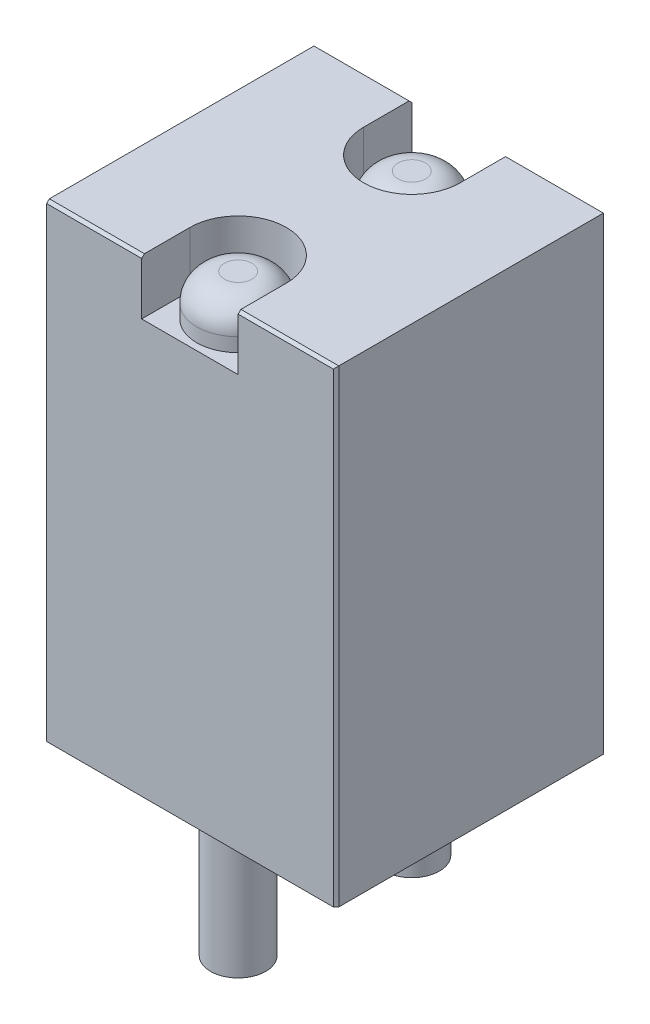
ISO-10303-21;
HEADER;
FILE_DESCRIPTION(('STEP AP214'),'2;1');
FILE_NAME('part.step','',(''),(''),'','','');
FILE_SCHEMA(('AUTOMOTIVE_DESIGN { 1 0 10303 214 1 1 1 1 }'));
ENDSEC;
DATA;
#1=APPLICATION_CONTEXT('core data for automotive mechanical design processes');
#2=APPLICATION_PROTOCOL_DEFINITION('international standard','automotive_design',2000,#1);
#3=PRODUCT_CONTEXT('',#1,'mechanical');
#4=PRODUCT('Part','Part','',(#3));
#5=PRODUCT_RELATED_PRODUCT_CATEGORY('part','',(#4));
#6=PRODUCT_DEFINITION_FORMATION('','',#4);
#7=PRODUCT_DEFINITION_CONTEXT('part definition',#1,'design');
#8=PRODUCT_DEFINITION('design','',#6,#7);
#9=PRODUCT_DEFINITION_SHAPE('','',#8);
#10=(LENGTH_UNIT() NAMED_UNIT(*) SI_UNIT(.MILLI.,.METRE.));
#11=(NAMED_UNIT(*) PLANE_ANGLE_UNIT() SI_UNIT($,.RADIAN.));
#12=(NAMED_UNIT(*) SI_UNIT($,.STERADIAN.) SOLID_ANGLE_UNIT());
#13=UNCERTAINTY_MEASURE_WITH_UNIT(LENGTH_MEASURE(1.E-05),#10,'distance_accuracy_value','');
#14=(GEOMETRIC_REPRESENTATION_CONTEXT(3) GLOBAL_UNCERTAINTY_ASSIGNED_CONTEXT((#13)) GLOBAL_UNIT_ASSIGNED_CONTEXT((#10,
#11,#12)) REPRESENTATION_CONTEXT('',''));
#15=CARTESIAN_POINT('',(0.,0.,0.));
#16=DIRECTION('',(0.,0.,1.));
#17=DIRECTION('',(1.,0.,0.));
#18=AXIS2_PLACEMENT_3D('',#15,#16,#17);
#19=CARTESIAN_POINT('',(-5.3,15.,-3.15));
#20=DIRECTION('',(0.,-1.,0.));
#21=DIRECTION('',(0.,0.,-1.));
#22=AXIS2_PLACEMENT_3D('',#19,#20,#21);
#23=PLANE('',#22);
#24=CARTESIAN_POINT('',(-5.3,15.,-3.15));
#25=DIRECTION('',(0.,1.,0.));
#26=DIRECTION('',(0.,0.,-1.));
#27=AXIS2_PLACEMENT_3D('',#24,#25,#26);
#28=CIRCLE('',#27,1.75);
#29=CARTESIAN_POINT('',(-7.05,15.,-3.15));
#30=VERTEX_POINT('',#29);
#31=CARTESIAN_POINT('',(-3.55,15.,-3.15));
#32=VERTEX_POINT('',#31);
#33=EDGE_CURVE('E179',#30,#32,#28,.T.);
#34=ORIENTED_EDGE('',*,*,#33,.T.);
#35=DIRECTION('',(0.,0.,-1.));
#36=VECTOR('',#35,1.);
#37=CARTESIAN_POINT('',(-3.55,15.,-3.15));
#38=LINE('',#37,#36);
#39=CARTESIAN_POINT('',(-3.55,15.,-4.9));
#40=VERTEX_POINT('',#39);
#41=EDGE_CURVE('E156',#32,#40,#38,.T.);
#42=ORIENTED_EDGE('',*,*,#41,.T.);
#43=DIRECTION('',(-1.,0.,0.));
#44=VECTOR('',#43,1.);
#45=CARTESIAN_POINT('',(-3.55,15.,-4.9));
#46=LINE('',#45,#44);
#47=CARTESIAN_POINT('',(-7.05,15.,-4.9));
#48=VERTEX_POINT('',#47);
#49=EDGE_CURVE('E185',#40,#48,#46,.T.);
#50=ORIENTED_EDGE('',*,*,#49,.T.);
#51=DIRECTION('',(0.,0.,1.));
#52=VECTOR('',#51,1.);
#53=CARTESIAN_POINT('',(-7.05,15.,-3.15));
#54=LINE('',#53,#52);
#55=EDGE_CURVE('E161',#48,#30,#54,.T.);
#56=ORIENTED_EDGE('',*,*,#55,.T.);
#57=EDGE_LOOP('',(#34,#42,#50,#56));
#58=FACE_BOUND('',#57,.T.);
#59=CARTESIAN_POINT('',(-5.3,15.,-3.15));
#60=DIRECTION('',(0.,-1.,0.));
#61=DIRECTION('',(0.,0.,-1.));
#62=AXIS2_PLACEMENT_3D('',#59,#60,#61);
#63=CIRCLE('',#62,1.5);
#64=CARTESIAN_POINT('',(-5.3,15.,-4.65));
#65=VERTEX_POINT('',#64);
#66=EDGE_CURVE('E236',#65,#65,#63,.F.);
#67=ORIENTED_EDGE('',*,*,#66,.F.);
#68=EDGE_LOOP('',(#67));
#69=FACE_BOUND('',#68,.T.);
#70=ADVANCED_FACE('F29',(#58,#69),#23,.F.);
#71=CARTESIAN_POINT('',(-5.3,15.,3.15));
#72=DIRECTION('',(0.,1.,0.));
#73=DIRECTION('',(0.,0.,1.));
#74=AXIS2_PLACEMENT_3D('',#71,#72,#73);
#75=PLANE('',#74);
#76=CARTESIAN_POINT('',(-5.3,15.,3.15));
#77=DIRECTION('',(0.,1.,0.));
#78=DIRECTION('',(0.,0.,1.));
#79=AXIS2_PLACEMENT_3D('',#76,#77,#78);
#80=CIRCLE('',#79,1.75);
#81=CARTESIAN_POINT('',(-3.55,15.,3.15));
#82=VERTEX_POINT('',#81);
#83=CARTESIAN_POINT('',(-7.05,15.,3.15));
#84=VERTEX_POINT('',#83);
#85=EDGE_CURVE('E202',#82,#84,#80,.T.);
#86=ORIENTED_EDGE('',*,*,#85,.T.);
#87=DIRECTION('',(0.,0.,1.));
#88=VECTOR('',#87,1.);
#89=CARTESIAN_POINT('',(-7.05,15.,3.15));
#90=LINE('',#89,#88);
#91=CARTESIAN_POINT('',(-7.05,15.,4.9));
#92=VERTEX_POINT('',#91);
#93=EDGE_CURVE('E205',#84,#92,#90,.T.);
#94=ORIENTED_EDGE('',*,*,#93,.T.);
#95=DIRECTION('',(1.,0.,0.));
#96=VECTOR('',#95,1.);
#97=CARTESIAN_POINT('',(-3.55,15.,4.9));
#98=LINE('',#97,#96);
#99=CARTESIAN_POINT('',(-3.55,15.,4.9));
#100=VERTEX_POINT('',#99);
#101=EDGE_CURVE('E207',#92,#100,#98,.T.);
#102=ORIENTED_EDGE('',*,*,#101,.T.);
#103=DIRECTION('',(0.,0.,-1.));
#104=VECTOR('',#103,1.);
#105=CARTESIAN_POINT('',(-3.55,15.,3.15));
#106=LINE('',#105,#104);
#107=EDGE_CURVE('E209',#100,#82,#106,.T.);
#108=ORIENTED_EDGE('',*,*,#107,.T.);
#109=EDGE_LOOP('',(#86,#94,#102,#108));
#110=FACE_BOUND('',#109,.T.);
#111=CARTESIAN_POINT('',(-5.3,15.,3.15));
#112=DIRECTION('',(0.,1.,0.));
#113=DIRECTION('',(0.,0.,1.));
#114=AXIS2_PLACEMENT_3D('',#111,#112,#113);
#115=CIRCLE('',#114,1.5);
#116=CARTESIAN_POINT('',(-5.3,15.,4.65));
#117=VERTEX_POINT('',#116);
#118=EDGE_CURVE('E339',#117,#117,#115,.T.);
#119=ORIENTED_EDGE('',*,*,#118,.F.);
#120=EDGE_LOOP('',(#119));
#121=FACE_BOUND('',#120,.T.);
#122=ADVANCED_FACE('F377',(#110,#121),#75,.T.);
#123=CARTESIAN_POINT('',(0.,0.,-4.9));
#124=DIRECTION('',(1.,0.,0.));
#125=DIRECTION('',(0.,0.,-1.));
#126=AXIS2_PLACEMENT_3D('',#123,#124,#125);
#127=PLANE('',#126);
#128=DIRECTION('',(0.,0.,1.));
#129=VECTOR('',#128,1.);
#130=CARTESIAN_POINT('',(0.,0.,-4.9));
#131=LINE('',#130,#129);
#132=CARTESIAN_POINT('',(0.,0.,-4.8));
#133=VERTEX_POINT('',#132);
#134=CARTESIAN_POINT('',(0.,0.,4.8));
#135=VERTEX_POINT('',#134);
#136=EDGE_CURVE('E233',#133,#135,#131,.T.);
#137=ORIENTED_EDGE('',*,*,#136,.F.);
#138=DIRECTION('',(0.,1.,0.));
#139=VECTOR('',#138,1.);
#140=CARTESIAN_POINT('',(0.,0.,-4.8));
#141=LINE('',#140,#139);
#142=CARTESIAN_POINT('',(0.,17.,-4.8));
#143=VERTEX_POINT('',#142);
#144=EDGE_CURVE('E283',#133,#143,#141,.T.);
#145=ORIENTED_EDGE('',*,*,#144,.T.);
#146=DIRECTION('',(0.,0.,1.));
#147=VECTOR('',#146,1.);
#148=CARTESIAN_POINT('',(0.,17.,-4.9));
#149=LINE('',#148,#147);
#150=CARTESIAN_POINT('',(0.,17.,4.8));
#151=VERTEX_POINT('',#150);
#152=EDGE_CURVE('E232',#143,#151,#149,.T.);
#153=ORIENTED_EDGE('',*,*,#152,.T.);
#154=DIRECTION('',(0.,-1.,0.));
#155=VECTOR('',#154,1.);
#156=CARTESIAN_POINT('',(0.,0.,4.8));
#157=LINE('',#156,#155);
#158=EDGE_CURVE('E281',#151,#135,#157,.T.);
#159=ORIENTED_EDGE('',*,*,#158,.T.);
#160=EDGE_LOOP('',(#137,#145,#153,#159));
#161=FACE_BOUND('',#160,.T.);
#162=ADVANCED_FACE('F31',(#161),#127,.T.);
#163=CARTESIAN_POINT('',(-10.5,0.,-4.9));
#164=DIRECTION('',(0.,-1.,0.));
#165=DIRECTION('',(0.,0.,-1.));
#166=AXIS2_PLACEMENT_3D('',#163,#164,#165);
#167=PLANE('',#166);
#168=CARTESIAN_POINT('',(-5.3,0.,3.15));
#169=DIRECTION('',(0.,1.,0.));
#170=DIRECTION('',(0.,0.,1.));
#171=AXIS2_PLACEMENT_3D('',#168,#169,#170);
#172=CIRCLE('',#171,1.25);
#173=CARTESIAN_POINT('',(-5.3,0.,4.4));
#174=VERTEX_POINT('',#173);
#175=EDGE_CURVE('E345',#174,#174,#172,.T.);
#176=ORIENTED_EDGE('',*,*,#175,.T.);
#177=EDGE_LOOP('',(#176));
#178=FACE_BOUND('',#177,.T.);
#179=CARTESIAN_POINT('',(-5.3,0.,-3.15));
#180=DIRECTION('',(0.,1.,0.));
#181=DIRECTION('',(0.,0.,1.));
#182=AXIS2_PLACEMENT_3D('',#179,#180,#181);
#183=CIRCLE('',#182,1.25);
#184=CARTESIAN_POINT('',(-5.3,0.,-1.9));
#185=VERTEX_POINT('',#184);
#186=EDGE_CURVE('E170',#185,#185,#183,.T.);
#187=ORIENTED_EDGE('',*,*,#186,.T.);
#188=EDGE_LOOP('',(#187));
#189=FACE_BOUND('',#188,.T.);
#190=DIRECTION('',(1.,0.,0.));
#191=VECTOR('',#190,1.);
#192=CARTESIAN_POINT('',(-10.5,0.,-4.9));
#193=LINE('',#192,#191);
#194=CARTESIAN_POINT('',(-10.5,0.,-4.9));
#195=VERTEX_POINT('',#194);
#196=CARTESIAN_POINT('',(-0.100000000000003,0.,-4.9));
#197=VERTEX_POINT('',#196);
#198=EDGE_CURVE('E229',#195,#197,#193,.T.);
#199=ORIENTED_EDGE('',*,*,#198,.T.);
#200=DIRECTION('',(-0.707106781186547,0.,-0.707106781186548));
#201=VECTOR('',#200,1.);
#202=CARTESIAN_POINT('',(-5.29999999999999,0.,-10.1));
#203=LINE('',#202,#201);
#204=EDGE_CURVE('E287',#197,#133,#203,.F.);
#205=ORIENTED_EDGE('',*,*,#204,.T.);
#206=ORIENTED_EDGE('',*,*,#136,.T.);
#207=DIRECTION('',(-0.707106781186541,0.,0.707106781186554));
#208=VECTOR('',#207,1.);
#209=CARTESIAN_POINT('',(-0.399999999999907,0.,5.19999999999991));
#210=LINE('',#209,#208);
#211=CARTESIAN_POINT('',(-0.0999999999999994,0.,4.9));
#212=VERTEX_POINT('',#211);
#213=EDGE_CURVE('E285',#135,#212,#210,.T.);
#214=ORIENTED_EDGE('',*,*,#213,.T.);
#215=DIRECTION('',(1.,0.,0.));
#216=VECTOR('',#215,1.);
#217=CARTESIAN_POINT('',(-10.5,0.,4.9));
#218=LINE('',#217,#216);
#219=CARTESIAN_POINT('',(-10.5,0.,4.9));
#220=VERTEX_POINT('',#219);
#221=EDGE_CURVE('E224',#220,#212,#218,.T.);
#222=ORIENTED_EDGE('',*,*,#221,.F.);
#223=DIRECTION('',(0.,0.,1.));
#224=VECTOR('',#223,1.);
#225=CARTESIAN_POINT('',(-10.5,0.,-4.9));
#226=LINE('',#225,#224);
#227=EDGE_CURVE('E237',#195,#220,#226,.T.);
#228=ORIENTED_EDGE('',*,*,#227,.F.);
#229=EDGE_LOOP('',(#199,#205,#206,#214,#222,#228));
#230=FACE_BOUND('',#229,.T.);
#231=ADVANCED_FACE('F310',(#178,#189,#230),#167,.T.);
#232=CARTESIAN_POINT('',(-10.5,17.,-4.9));
#233=DIRECTION('',(-1.,0.,0.));
#234=DIRECTION('',(0.,-1.,0.));
#235=AXIS2_PLACEMENT_3D('',#232,#233,#234);
#236=PLANE('',#235);
#237=DIRECTION('',(0.,0.,1.));
#238=VECTOR('',#237,1.);
#239=CARTESIAN_POINT('',(-10.5,17.,-4.9));
#240=LINE('',#239,#238);
#241=CARTESIAN_POINT('',(-10.5,17.,-4.8));
#242=VERTEX_POINT('',#241);
#243=CARTESIAN_POINT('',(-10.5,17.,4.8));
#244=VERTEX_POINT('',#243);
#245=EDGE_CURVE('E240',#242,#244,#240,.T.);
#246=ORIENTED_EDGE('',*,*,#245,.F.);
#247=DIRECTION('',(0.,0.707106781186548,0.707106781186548));
#248=VECTOR('',#247,1.);
#249=CARTESIAN_POINT('',(-10.5,16.95,-4.85));
#250=LINE('',#249,#248);
#251=CARTESIAN_POINT('',(-10.5,16.9,-4.9));
#252=VERTEX_POINT('',#251);
#253=EDGE_CURVE('E269',#242,#252,#250,.F.);
#254=ORIENTED_EDGE('',*,*,#253,.T.);
#255=DIRECTION('',(0.,-1.,0.));
#256=VECTOR('',#255,1.);
#257=CARTESIAN_POINT('',(-10.5,17.,-4.9));
#258=LINE('',#257,#256);
#259=EDGE_CURVE('E227',#252,#195,#258,.T.);
#260=ORIENTED_EDGE('',*,*,#259,.T.);
#261=ORIENTED_EDGE('',*,*,#227,.T.);
#262=DIRECTION('',(0.,-1.,0.));
#263=VECTOR('',#262,1.);
#264=CARTESIAN_POINT('',(-10.5,17.,4.9));
#265=LINE('',#264,#263);
#266=CARTESIAN_POINT('',(-10.5,16.9,4.9));
#267=VERTEX_POINT('',#266);
#268=EDGE_CURVE('E216',#267,#220,#265,.T.);
#269=ORIENTED_EDGE('',*,*,#268,.F.);
#270=DIRECTION('',(0.,0.707106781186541,-0.707106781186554));
#271=VECTOR('',#270,1.);
#272=CARTESIAN_POINT('',(-10.5,21.85,-0.0500000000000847));
#273=LINE('',#272,#271);
#274=EDGE_CURVE('E267',#267,#244,#273,.T.);
#275=ORIENTED_EDGE('',*,*,#274,.T.);
#276=EDGE_LOOP('',(#246,#254,#260,#261,#269,#275));
#277=FACE_BOUND('',#276,.T.);
#278=ADVANCED_FACE('F304',(#277),#236,.T.);
#279=CARTESIAN_POINT('',(-10.5,17.,-4.9));
#280=DIRECTION('',(0.,1.,0.));
#281=DIRECTION('',(0.,0.,1.));
#282=AXIS2_PLACEMENT_3D('',#279,#280,#281);
#283=PLANE('',#282);
#284=DIRECTION('',(0.,0.,1.));
#285=VECTOR('',#284,1.);
#286=CARTESIAN_POINT('',(-7.05,17.,-3.15));
#287=LINE('',#286,#285);
#288=CARTESIAN_POINT('',(-7.05,17.,-4.8));
#289=VERTEX_POINT('',#288);
#290=CARTESIAN_POINT('',(-7.05,17.,-3.15));
#291=VERTEX_POINT('',#290);
#292=EDGE_CURVE('E177',#289,#291,#287,.T.);
#293=ORIENTED_EDGE('',*,*,#292,.F.);
#294=DIRECTION('',(-1.,0.,0.));
#295=VECTOR('',#294,1.);
#296=CARTESIAN_POINT('',(-10.5,17.,-4.8));
#297=LINE('',#296,#295);
#298=EDGE_CURVE('E264',#289,#242,#297,.T.);
#299=ORIENTED_EDGE('',*,*,#298,.T.);
#300=ORIENTED_EDGE('',*,*,#245,.T.);
#301=DIRECTION('',(1.,0.,0.));
#302=VECTOR('',#301,1.);
#303=CARTESIAN_POINT('',(-7.05,17.,4.8));
#304=LINE('',#303,#302);
#305=CARTESIAN_POINT('',(-7.05,17.,4.8));
#306=VERTEX_POINT('',#305);
#307=EDGE_CURVE('E261',#244,#306,#304,.T.);
#308=ORIENTED_EDGE('',*,*,#307,.T.);
#309=DIRECTION('',(0.,0.,1.));
#310=VECTOR('',#309,1.);
#311=CARTESIAN_POINT('',(-7.05,17.,3.15));
#312=LINE('',#311,#310);
#313=CARTESIAN_POINT('',(-7.05,17.,3.15));
#314=VERTEX_POINT('',#313);
#315=EDGE_CURVE('E198',#314,#306,#312,.T.);
#316=ORIENTED_EDGE('',*,*,#315,.F.);
#317=CARTESIAN_POINT('',(-5.3,17.,3.15));
#318=DIRECTION('',(0.,1.,0.));
#319=DIRECTION('',(0.,0.,1.));
#320=AXIS2_PLACEMENT_3D('',#317,#318,#319);
#321=CIRCLE('',#320,1.75);
#322=CARTESIAN_POINT('',(-3.55,17.,3.15));
#323=VERTEX_POINT('',#322);
#324=EDGE_CURVE('E190',#323,#314,#321,.T.);
#325=ORIENTED_EDGE('',*,*,#324,.F.);
#326=DIRECTION('',(0.,0.,-1.));
#327=VECTOR('',#326,1.);
#328=CARTESIAN_POINT('',(-3.55,17.,3.15));
#329=LINE('',#328,#327);
#330=CARTESIAN_POINT('',(-3.55,17.,4.8));
#331=VERTEX_POINT('',#330);
#332=EDGE_CURVE('E200',#331,#323,#329,.T.);
#333=ORIENTED_EDGE('',*,*,#332,.F.);
#334=DIRECTION('',(1.,0.,0.));
#335=VECTOR('',#334,1.);
#336=CARTESIAN_POINT('',(0.,17.,4.8));
#337=LINE('',#336,#335);
#338=EDGE_CURVE('E259',#331,#151,#337,.T.);
#339=ORIENTED_EDGE('',*,*,#338,.T.);
#340=ORIENTED_EDGE('',*,*,#152,.F.);
#341=DIRECTION('',(-1.,0.,0.));
#342=VECTOR('',#341,1.);
#343=CARTESIAN_POINT('',(-10.5,17.,-4.8));
#344=LINE('',#343,#342);
#345=CARTESIAN_POINT('',(-3.55,17.,-4.8));
#346=VERTEX_POINT('',#345);
#347=EDGE_CURVE('E176',#143,#346,#344,.T.);
#348=ORIENTED_EDGE('',*,*,#347,.T.);
#349=DIRECTION('',(0.,0.,-1.));
#350=VECTOR('',#349,1.);
#351=CARTESIAN_POINT('',(-3.55,17.,-3.15));
#352=LINE('',#351,#350);
#353=CARTESIAN_POINT('',(-3.55,17.,-3.15));
#354=VERTEX_POINT('',#353);
#355=EDGE_CURVE('E154',#354,#346,#352,.T.);
#356=ORIENTED_EDGE('',*,*,#355,.F.);
#357=CARTESIAN_POINT('',(-5.3,17.,-3.15));
#358=DIRECTION('',(0.,1.,0.));
#359=DIRECTION('',(0.,0.,-1.));
#360=AXIS2_PLACEMENT_3D('',#357,#358,#359);
#361=CIRCLE('',#360,1.75);
#362=EDGE_CURVE('E165',#291,#354,#361,.T.);
#363=ORIENTED_EDGE('',*,*,#362,.F.);
#364=EDGE_LOOP('',(#293,#299,#300,#308,#316,#325,#333,#339,#340,#348,#356,#363));
#365=FACE_BOUND('',#364,.T.);
#366=ADVANCED_FACE('F173',(#365),#283,.T.);
#367=CARTESIAN_POINT('',(0.,17.,-4.9));
#368=DIRECTION('',(0.,0.,-1.));
#369=DIRECTION('',(-1.,0.,0.));
#370=AXIS2_PLACEMENT_3D('',#367,#368,#369);
#371=PLANE('',#370);
#372=ORIENTED_EDGE('',*,*,#259,.F.);
#373=DIRECTION('',(1.,0.,0.));
#374=VECTOR('',#373,1.);
#375=CARTESIAN_POINT('',(0.,16.9,-4.9));
#376=LINE('',#375,#374);
#377=CARTESIAN_POINT('',(-7.05,16.9,-4.9));
#378=VERTEX_POINT('',#377);
#379=EDGE_CURVE('E275',#252,#378,#376,.T.);
#380=ORIENTED_EDGE('',*,*,#379,.T.);
#381=DIRECTION('',(0.,1.,0.));
#382=VECTOR('',#381,1.);
#383=CARTESIAN_POINT('',(-7.05,15.,-4.9));
#384=LINE('',#383,#382);
#385=EDGE_CURVE('E191',#48,#378,#384,.T.);
#386=ORIENTED_EDGE('',*,*,#385,.F.);
#387=ORIENTED_EDGE('',*,*,#49,.F.);
#388=DIRECTION('',(0.,1.,0.));
#389=VECTOR('',#388,1.);
#390=CARTESIAN_POINT('',(-3.55,15.,-4.9));
#391=LINE('',#390,#389);
#392=CARTESIAN_POINT('',(-3.55,16.9,-4.9));
#393=VERTEX_POINT('',#392);
#394=EDGE_CURVE('E160',#40,#393,#391,.T.);
#395=ORIENTED_EDGE('',*,*,#394,.T.);
#396=DIRECTION('',(1.,0.,0.));
#397=VECTOR('',#396,1.);
#398=CARTESIAN_POINT('',(0.,16.9,-4.9));
#399=LINE('',#398,#397);
#400=CARTESIAN_POINT('',(-0.0999999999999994,16.9,-4.9));
#401=VERTEX_POINT('',#400);
#402=EDGE_CURVE('E273',#393,#401,#399,.T.);
#403=ORIENTED_EDGE('',*,*,#402,.T.);
#404=DIRECTION('',(0.,-1.,0.));
#405=VECTOR('',#404,1.);
#406=CARTESIAN_POINT('',(-0.0999999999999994,17.,-4.9));
#407=LINE('',#406,#405);
#408=EDGE_CURVE('E271',#401,#197,#407,.T.);
#409=ORIENTED_EDGE('',*,*,#408,.T.);
#410=ORIENTED_EDGE('',*,*,#198,.F.);
#411=EDGE_LOOP('',(#372,#380,#386,#387,#395,#403,#409,#410));
#412=FACE_BOUND('',#411,.T.);
#413=ADVANCED_FACE('F409',(#412),#371,.T.);
#414=CARTESIAN_POINT('',(0.,17.,4.9));
#415=DIRECTION('',(0.,0.,-1.));
#416=DIRECTION('',(-1.,0.,0.));
#417=AXIS2_PLACEMENT_3D('',#414,#415,#416);
#418=PLANE('',#417);
#419=DIRECTION('',(0.,1.,0.));
#420=VECTOR('',#419,1.);
#421=CARTESIAN_POINT('',(-7.05,15.,4.9));
#422=LINE('',#421,#420);
#423=CARTESIAN_POINT('',(-7.05,16.9,4.9));
#424=VERTEX_POINT('',#423);
#425=EDGE_CURVE('E220',#92,#424,#422,.T.);
#426=ORIENTED_EDGE('',*,*,#425,.T.);
#427=DIRECTION('',(-1.,0.,0.));
#428=VECTOR('',#427,1.);
#429=CARTESIAN_POINT('',(-10.5,16.9,4.9));
#430=LINE('',#429,#428);
#431=EDGE_CURVE('E294',#424,#267,#430,.T.);
#432=ORIENTED_EDGE('',*,*,#431,.T.);
#433=ORIENTED_EDGE('',*,*,#268,.T.);
#434=ORIENTED_EDGE('',*,*,#221,.T.);
#435=DIRECTION('',(0.,1.,0.));
#436=VECTOR('',#435,1.);
#437=CARTESIAN_POINT('',(-0.0999999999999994,17.,4.9));
#438=LINE('',#437,#436);
#439=CARTESIAN_POINT('',(-0.0999999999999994,16.9,4.9));
#440=VERTEX_POINT('',#439);
#441=EDGE_CURVE('E291',#212,#440,#438,.T.);
#442=ORIENTED_EDGE('',*,*,#441,.T.);
#443=DIRECTION('',(-1.,0.,0.));
#444=VECTOR('',#443,1.);
#445=CARTESIAN_POINT('',(-3.55,16.9,4.9));
#446=LINE('',#445,#444);
#447=CARTESIAN_POINT('',(-3.55,16.9,4.9));
#448=VERTEX_POINT('',#447);
#449=EDGE_CURVE('E289',#440,#448,#446,.T.);
#450=ORIENTED_EDGE('',*,*,#449,.T.);
#451=DIRECTION('',(0.,1.,0.));
#452=VECTOR('',#451,1.);
#453=CARTESIAN_POINT('',(-3.55,15.,4.9));
#454=LINE('',#453,#452);
#455=EDGE_CURVE('E217',#100,#448,#454,.T.);
#456=ORIENTED_EDGE('',*,*,#455,.F.);
#457=ORIENTED_EDGE('',*,*,#101,.F.);
#458=EDGE_LOOP('',(#426,#432,#433,#434,#442,#450,#456,#457));
#459=FACE_BOUND('',#458,.T.);
#460=ADVANCED_FACE('F299',(#459),#418,.F.);
#461=CARTESIAN_POINT('',(-5.3,15.,3.15));
#462=DIRECTION('',(0.,1.,0.));
#463=DIRECTION('',(0.,0.,1.));
#464=AXIS2_PLACEMENT_3D('',#461,#462,#463);
#465=CYLINDRICAL_SURFACE('',#464,1.75);
#466=ORIENTED_EDGE('',*,*,#324,.T.);
#467=DIRECTION('',(0.,1.,0.));
#468=VECTOR('',#467,1.);
#469=CARTESIAN_POINT('',(-7.05,15.,3.15));
#470=LINE('',#469,#468);
#471=EDGE_CURVE('E212',#84,#314,#470,.T.);
#472=ORIENTED_EDGE('',*,*,#471,.F.);
#473=ORIENTED_EDGE('',*,*,#85,.F.);
#474=DIRECTION('',(0.,1.,0.));
#475=VECTOR('',#474,1.);
#476=CARTESIAN_POINT('',(-3.55,15.,3.15));
#477=LINE('',#476,#475);
#478=EDGE_CURVE('E213',#82,#323,#477,.T.);
#479=ORIENTED_EDGE('',*,*,#478,.T.);
#480=EDGE_LOOP('',(#466,#472,#473,#479));
#481=FACE_BOUND('',#480,.T.);
#482=ADVANCED_FACE('F400',(#481),#465,.F.);
#483=CARTESIAN_POINT('',(-3.55,15.,3.15));
#484=DIRECTION('',(1.,0.,0.));
#485=DIRECTION('',(0.,0.,-1.));
#486=AXIS2_PLACEMENT_3D('',#483,#484,#485);
#487=PLANE('',#486);
#488=ORIENTED_EDGE('',*,*,#455,.T.);
#489=DIRECTION('',(0.,0.707106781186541,-0.707106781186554));
#490=VECTOR('',#489,1.);
#491=CARTESIAN_POINT('',(-3.55,16.9,4.9));
#492=LINE('',#491,#490);
#493=EDGE_CURVE('E11',#448,#331,#492,.T.);
#494=ORIENTED_EDGE('',*,*,#493,.T.);
#495=ORIENTED_EDGE('',*,*,#332,.T.);
#496=ORIENTED_EDGE('',*,*,#478,.F.);
#497=ORIENTED_EDGE('',*,*,#107,.F.);
#498=EDGE_LOOP('',(#488,#494,#495,#496,#497));
#499=FACE_BOUND('',#498,.T.);
#500=ADVANCED_FACE('F397',(#499),#487,.F.);
#501=CARTESIAN_POINT('',(-7.05,15.,3.15));
#502=DIRECTION('',(-1.,0.,0.));
#503=DIRECTION('',(0.,0.,1.));
#504=AXIS2_PLACEMENT_3D('',#501,#502,#503);
#505=PLANE('',#504);
#506=ORIENTED_EDGE('',*,*,#315,.T.);
#507=DIRECTION('',(0.,-0.707106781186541,0.707106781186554));
#508=VECTOR('',#507,1.);
#509=CARTESIAN_POINT('',(-7.05,16.9,4.9));
#510=LINE('',#509,#508);
#511=EDGE_CURVE('E37',#306,#424,#510,.T.);
#512=ORIENTED_EDGE('',*,*,#511,.T.);
#513=ORIENTED_EDGE('',*,*,#425,.F.);
#514=ORIENTED_EDGE('',*,*,#93,.F.);
#515=ORIENTED_EDGE('',*,*,#471,.T.);
#516=EDGE_LOOP('',(#506,#512,#513,#514,#515));
#517=FACE_BOUND('',#516,.T.);
#518=ADVANCED_FACE('F395',(#517),#505,.F.);
#519=CARTESIAN_POINT('',(-5.3,15.,-3.15));
#520=DIRECTION('',(0.,1.,0.));
#521=DIRECTION('',(0.,0.,1.));
#522=AXIS2_PLACEMENT_3D('',#519,#520,#521);
#523=CYLINDRICAL_SURFACE('',#522,1.75);
#524=ORIENTED_EDGE('',*,*,#362,.T.);
#525=DIRECTION('',(0.,1.,0.));
#526=VECTOR('',#525,1.);
#527=CARTESIAN_POINT('',(-3.55,15.,-3.15));
#528=LINE('',#527,#526);
#529=EDGE_CURVE('E150',#32,#354,#528,.T.);
#530=ORIENTED_EDGE('',*,*,#529,.F.);
#531=ORIENTED_EDGE('',*,*,#33,.F.);
#532=DIRECTION('',(0.,1.,0.));
#533=VECTOR('',#532,1.);
#534=CARTESIAN_POINT('',(-7.05,15.,-3.15));
#535=LINE('',#534,#533);
#536=EDGE_CURVE('E167',#30,#291,#535,.T.);
#537=ORIENTED_EDGE('',*,*,#536,.T.);
#538=EDGE_LOOP('',(#524,#530,#531,#537));
#539=FACE_BOUND('',#538,.T.);
#540=ADVANCED_FACE('F166',(#539),#523,.F.);
#541=CARTESIAN_POINT('',(-7.05,15.,-3.15));
#542=DIRECTION('',(-1.,0.,0.));
#543=DIRECTION('',(0.,0.,1.));
#544=AXIS2_PLACEMENT_3D('',#541,#542,#543);
#545=PLANE('',#544);
#546=ORIENTED_EDGE('',*,*,#385,.T.);
#547=DIRECTION('',(0.,-0.707106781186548,-0.707106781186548));
#548=VECTOR('',#547,1.);
#549=CARTESIAN_POINT('',(-7.05,17.,-4.8));
#550=LINE('',#549,#548);
#551=EDGE_CURVE('E277',#378,#289,#550,.F.);
#552=ORIENTED_EDGE('',*,*,#551,.T.);
#553=ORIENTED_EDGE('',*,*,#292,.T.);
#554=ORIENTED_EDGE('',*,*,#536,.F.);
#555=ORIENTED_EDGE('',*,*,#55,.F.);
#556=EDGE_LOOP('',(#546,#552,#553,#554,#555));
#557=FACE_BOUND('',#556,.T.);
#558=ADVANCED_FACE('F388',(#557),#545,.F.);
#559=CARTESIAN_POINT('',(-3.55,15.,-3.15));
#560=DIRECTION('',(1.,0.,0.));
#561=DIRECTION('',(0.,0.,-1.));
#562=AXIS2_PLACEMENT_3D('',#559,#560,#561);
#563=PLANE('',#562);
#564=ORIENTED_EDGE('',*,*,#355,.T.);
#565=DIRECTION('',(0.,0.707106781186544,0.707106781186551));
#566=VECTOR('',#565,1.);
#567=CARTESIAN_POINT('',(-3.55,17.,-4.8));
#568=LINE('',#567,#566);
#569=EDGE_CURVE('E279',#346,#393,#568,.F.);
#570=ORIENTED_EDGE('',*,*,#569,.T.);
#571=ORIENTED_EDGE('',*,*,#394,.F.);
#572=ORIENTED_EDGE('',*,*,#41,.F.);
#573=ORIENTED_EDGE('',*,*,#529,.T.);
#574=EDGE_LOOP('',(#564,#570,#571,#572,#573));
#575=FACE_BOUND('',#574,.T.);
#576=ADVANCED_FACE('F152',(#575),#563,.F.);
#577=CARTESIAN_POINT('',(-5.3,0.,-3.15));
#578=DIRECTION('',(0.,1.,0.));
#579=DIRECTION('',(0.,0.,1.));
#580=AXIS2_PLACEMENT_3D('',#577,#578,#579);
#581=CYLINDRICAL_SURFACE('',#580,1.25);
#582=CARTESIAN_POINT('',(-5.3,15.,-3.15));
#583=DIRECTION('',(0.,1.,0.));
#584=DIRECTION('',(0.,0.,1.));
#585=AXIS2_PLACEMENT_3D('',#582,#583,#584);
#586=CIRCLE('',#585,1.25);
#587=CARTESIAN_POINT('',(-5.3,15.,-1.9));
#588=VERTEX_POINT('',#587);
#589=EDGE_CURVE('E336',#588,#588,#586,.F.);
#590=CARTESIAN_POINT('',(-5.3,0.,-1.9));
#591=CARTESIAN_POINT('',(-5.3,0.15625,-1.9));
#592=CARTESIAN_POINT('',(-5.3,0.3125,-1.9));
#593=CARTESIAN_POINT('',(-5.3,0.625,-1.9));
#594=CARTESIAN_POINT('',(-5.3,0.78125,-1.9));
#595=CARTESIAN_POINT('',(-5.3,1.09375,-1.9));
#596=CARTESIAN_POINT('',(-5.3,1.25,-1.9));
#597=CARTESIAN_POINT('',(-5.3,1.5625,-1.9));
#598=CARTESIAN_POINT('',(-5.3,1.71875,-1.9));
#599=CARTESIAN_POINT('',(-5.3,2.03125,-1.9));
#600=CARTESIAN_POINT('',(-5.3,2.1875,-1.9));
#601=CARTESIAN_POINT('',(-5.3,2.5,-1.9));
#602=CARTESIAN_POINT('',(-5.3,2.65625,-1.9));
#603=CARTESIAN_POINT('',(-5.3,2.96875,-1.9));
#604=CARTESIAN_POINT('',(-5.3,3.125,-1.9));
#605=CARTESIAN_POINT('',(-5.3,3.4375,-1.9));
#606=CARTESIAN_POINT('',(-5.3,3.59375,-1.9));
#607=CARTESIAN_POINT('',(-5.3,3.90625,-1.9));
#608=CARTESIAN_POINT('',(-5.3,4.0625,-1.9));
#609=CARTESIAN_POINT('',(-5.3,4.375,-1.9));
#610=CARTESIAN_POINT('',(-5.3,4.53125,-1.9));
#611=CARTESIAN_POINT('',(-5.3,4.84375,-1.9));
#612=CARTESIAN_POINT('',(-5.3,5.,-1.9));
#613=CARTESIAN_POINT('',(-5.3,5.3125,-1.9));
#614=CARTESIAN_POINT('',(-5.3,5.46875,-1.9));
#615=CARTESIAN_POINT('',(-5.3,5.78125,-1.9));
#616=CARTESIAN_POINT('',(-5.3,5.9375,-1.9));
#617=CARTESIAN_POINT('',(-5.3,6.25,-1.9));
#618=CARTESIAN_POINT('',(-5.3,6.40625,-1.9));
#619=CARTESIAN_POINT('',(-5.3,6.71875,-1.9));
#620=CARTESIAN_POINT('',(-5.3,6.875,-1.9));
#621=CARTESIAN_POINT('',(-5.3,7.1875,-1.9));
#622=CARTESIAN_POINT('',(-5.3,7.34375,-1.9));
#623=CARTESIAN_POINT('',(-5.3,7.65625,-1.9));
#624=CARTESIAN_POINT('',(-5.3,7.8125,-1.9));
#625=CARTESIAN_POINT('',(-5.3,8.125,-1.9));
#626=CARTESIAN_POINT('',(-5.3,8.28125,-1.9));
#627=CARTESIAN_POINT('',(-5.3,8.59375,-1.9));
#628=CARTESIAN_POINT('',(-5.3,8.75,-1.9));
#629=CARTESIAN_POINT('',(-5.3,9.0625,-1.9));
#630=CARTESIAN_POINT('',(-5.3,9.21875,-1.9));
#631=CARTESIAN_POINT('',(-5.3,9.53125,-1.9));
#632=CARTESIAN_POINT('',(-5.3,9.6875,-1.9));
#633=CARTESIAN_POINT('',(-5.3,10.,-1.9));
#634=CARTESIAN_POINT('',(-5.3,10.15625,-1.9));
#635=CARTESIAN_POINT('',(-5.3,10.46875,-1.9));
#636=CARTESIAN_POINT('',(-5.3,10.625,-1.9));
#637=CARTESIAN_POINT('',(-5.3,10.9375,-1.9));
#638=CARTESIAN_POINT('',(-5.3,11.09375,-1.9));
#639=CARTESIAN_POINT('',(-5.3,11.40625,-1.9));
#640=CARTESIAN_POINT('',(-5.3,11.5625,-1.9));
#641=CARTESIAN_POINT('',(-5.3,11.875,-1.9));
#642=CARTESIAN_POINT('',(-5.3,12.03125,-1.9));
#643=CARTESIAN_POINT('',(-5.3,12.34375,-1.9));
#644=CARTESIAN_POINT('',(-5.3,12.5,-1.9));
#645=CARTESIAN_POINT('',(-5.3,12.8125,-1.9));
#646=CARTESIAN_POINT('',(-5.3,12.96875,-1.9));
#647=CARTESIAN_POINT('',(-5.3,13.28125,-1.9));
#648=CARTESIAN_POINT('',(-5.3,13.4375,-1.9));
#649=CARTESIAN_POINT('',(-5.3,13.75,-1.9));
#650=CARTESIAN_POINT('',(-5.3,13.90625,-1.9));
#651=CARTESIAN_POINT('',(-5.3,14.21875,-1.9));
#652=CARTESIAN_POINT('',(-5.3,14.375,-1.9));
#653=CARTESIAN_POINT('',(-5.3,14.6875,-1.9));
#654=CARTESIAN_POINT('',(-5.3,14.84375,-1.9));
#655=CARTESIAN_POINT('',(-5.3,15.,-1.9));
#656=B_SPLINE_CURVE_WITH_KNOTS('',3,(#590,#591,#592,#593,#594,#595,#596,#597,#598,#599,#600,
#601,#602,#603,#604,#605,#606,#607,#608,#609,#610,#611,#612,#613,#614,#615,#616,#617,#618,#619,
#620,#621,#622,#623,#624,#625,#626,#627,#628,#629,#630,#631,#632,#633,#634,#635,#636,#637,#638,
#639,#640,#641,#642,#643,#644,#645,#646,#647,#648,#649,#650,#651,#652,#653,#654,#655),
.UNSPECIFIED.,.F.,.F.,(4,2,2,2,2,2,2,2,2,2,2,2,2,2,2,2,2,2,2,2,2,2,2,2,2,2,2,2,2,2,2,2,4),(0.,
0.46875,0.9375,1.40625,1.875,2.34375,2.8125,3.28125,3.75,4.21875,4.6875,5.15625,5.625,6.09375,
6.5625,7.03125,7.5,7.96875,8.4375,8.90625,9.375,9.84375,10.3125,10.78125,11.25,11.71875,12.1875,
12.65625,13.125,13.59375,14.0625,14.53125,15.),.UNSPECIFIED.);
#657=EDGE_CURVE('BSEAM351',#185,#588,#656,.T.);
#658=ORIENTED_EDGE('',*,*,#186,.F.);
#659=ORIENTED_EDGE('',*,*,#589,.F.);
#660=ORIENTED_EDGE('',*,*,#657,.T.);
#661=ORIENTED_EDGE('',*,*,#657,.F.);
#662=EDGE_LOOP('',(#658,#660,#659,#661));
#663=FACE_BOUND('',#662,.T.);
#664=ADVANCED_FACE('F351',(#663),#581,.F.);
#665=CARTESIAN_POINT('',(-5.3,0.,3.15));
#666=DIRECTION('',(0.,1.,0.));
#667=DIRECTION('',(0.,0.,1.));
#668=AXIS2_PLACEMENT_3D('',#665,#666,#667);
#669=CYLINDRICAL_SURFACE('',#668,1.25);
#670=CARTESIAN_POINT('',(-5.3,15.,3.15));
#671=DIRECTION('',(0.,1.,0.));
#672=DIRECTION('',(0.,0.,1.));
#673=AXIS2_PLACEMENT_3D('',#670,#671,#672);
#674=CIRCLE('',#673,1.25);
#675=CARTESIAN_POINT('',(-5.3,15.,4.4));
#676=VERTEX_POINT('',#675);
#677=EDGE_CURVE('E342',#676,#676,#674,.F.);
#678=CARTESIAN_POINT('',(-5.3,0.,4.4));
#679=CARTESIAN_POINT('',(-5.3,0.15625,4.4));
#680=CARTESIAN_POINT('',(-5.3,0.3125,4.4));
#681=CARTESIAN_POINT('',(-5.3,0.625,4.4));
#682=CARTESIAN_POINT('',(-5.3,0.78125,4.4));
#683=CARTESIAN_POINT('',(-5.3,1.09375,4.4));
#684=CARTESIAN_POINT('',(-5.3,1.25,4.4));
#685=CARTESIAN_POINT('',(-5.3,1.5625,4.4));
#686=CARTESIAN_POINT('',(-5.3,1.71875,4.4));
#687=CARTESIAN_POINT('',(-5.3,2.03125,4.4));
#688=CARTESIAN_POINT('',(-5.3,2.1875,4.4));
#689=CARTESIAN_POINT('',(-5.3,2.5,4.4));
#690=CARTESIAN_POINT('',(-5.3,2.65625,4.4));
#691=CARTESIAN_POINT('',(-5.3,2.96875,4.4));
#692=CARTESIAN_POINT('',(-5.3,3.125,4.4));
#693=CARTESIAN_POINT('',(-5.3,3.4375,4.4));
#694=CARTESIAN_POINT('',(-5.3,3.59375,4.4));
#695=CARTESIAN_POINT('',(-5.3,3.90625,4.4));
#696=CARTESIAN_POINT('',(-5.3,4.0625,4.4));
#697=CARTESIAN_POINT('',(-5.3,4.375,4.4));
#698=CARTESIAN_POINT('',(-5.3,4.53125,4.4));
#699=CARTESIAN_POINT('',(-5.3,4.84375,4.4));
#700=CARTESIAN_POINT('',(-5.3,5.,4.4));
#701=CARTESIAN_POINT('',(-5.3,5.3125,4.4));
#702=CARTESIAN_POINT('',(-5.3,5.46875,4.4));
#703=CARTESIAN_POINT('',(-5.3,5.78125,4.4));
#704=CARTESIAN_POINT('',(-5.3,5.9375,4.4));
#705=CARTESIAN_POINT('',(-5.3,6.25,4.4));
#706=CARTESIAN_POINT('',(-5.3,6.40625,4.4));
#707=CARTESIAN_POINT('',(-5.3,6.71875,4.4));
#708=CARTESIAN_POINT('',(-5.3,6.875,4.4));
#709=CARTESIAN_POINT('',(-5.3,7.1875,4.4));
#710=CARTESIAN_POINT('',(-5.3,7.34375,4.4));
#711=CARTESIAN_POINT('',(-5.3,7.65625,4.4));
#712=CARTESIAN_POINT('',(-5.3,7.8125,4.4));
#713=CARTESIAN_POINT('',(-5.3,8.125,4.4));
#714=CARTESIAN_POINT('',(-5.3,8.28125,4.4));
#715=CARTESIAN_POINT('',(-5.3,8.59375,4.4));
#716=CARTESIAN_POINT('',(-5.3,8.75,4.4));
#717=CARTESIAN_POINT('',(-5.3,9.0625,4.4));
#718=CARTESIAN_POINT('',(-5.3,9.21875,4.4));
#719=CARTESIAN_POINT('',(-5.3,9.53125,4.4));
#720=CARTESIAN_POINT('',(-5.3,9.6875,4.4));
#721=CARTESIAN_POINT('',(-5.3,10.,4.4));
#722=CARTESIAN_POINT('',(-5.3,10.15625,4.4));
#723=CARTESIAN_POINT('',(-5.3,10.46875,4.4));
#724=CARTESIAN_POINT('',(-5.3,10.625,4.4));
#725=CARTESIAN_POINT('',(-5.3,10.9375,4.4));
#726=CARTESIAN_POINT('',(-5.3,11.09375,4.4));
#727=CARTESIAN_POINT('',(-5.3,11.40625,4.4));
#728=CARTESIAN_POINT('',(-5.3,11.5625,4.4));
#729=CARTESIAN_POINT('',(-5.3,11.875,4.4));
#730=CARTESIAN_POINT('',(-5.3,12.03125,4.4));
#731=CARTESIAN_POINT('',(-5.3,12.34375,4.4));
#732=CARTESIAN_POINT('',(-5.3,12.5,4.4));
#733=CARTESIAN_POINT('',(-5.3,12.8125,4.4));
#734=CARTESIAN_POINT('',(-5.3,12.96875,4.4));
#735=CARTESIAN_POINT('',(-5.3,13.28125,4.4));
#736=CARTESIAN_POINT('',(-5.3,13.4375,4.4));
#737=CARTESIAN_POINT('',(-5.3,13.75,4.4));
#738=CARTESIAN_POINT('',(-5.3,13.90625,4.4));
#739=CARTESIAN_POINT('',(-5.3,14.21875,4.4));
#740=CARTESIAN_POINT('',(-5.3,14.375,4.4));
#741=CARTESIAN_POINT('',(-5.3,14.6875,4.4));
#742=CARTESIAN_POINT('',(-5.3,14.84375,4.4));
#743=CARTESIAN_POINT('',(-5.3,15.,4.4));
#744=B_SPLINE_CURVE_WITH_KNOTS('',3,(#678,#679,#680,#681,#682,#683,#684,#685,#686,#687,#688,
#689,#690,#691,#692,#693,#694,#695,#696,#697,#698,#699,#700,#701,#702,#703,#704,#705,#706,#707,
#708,#709,#710,#711,#712,#713,#714,#715,#716,#717,#718,#719,#720,#721,#722,#723,#724,#725,#726,
#727,#728,#729,#730,#731,#732,#733,#734,#735,#736,#737,#738,#739,#740,#741,#742,#743),
.UNSPECIFIED.,.F.,.F.,(4,2,2,2,2,2,2,2,2,2,2,2,2,2,2,2,2,2,2,2,2,2,2,2,2,2,2,2,2,2,2,2,4),(0.,
0.46875,0.9375,1.40625,1.875,2.34375,2.8125,3.28125,3.75,4.21875,4.6875,5.15625,5.625,6.09375,
6.5625,7.03125,7.5,7.96875,8.4375,8.90625,9.375,9.84375,10.3125,10.78125,11.25,11.71875,12.1875,
12.65625,13.125,13.59375,14.0625,14.53125,15.),.UNSPECIFIED.);
#745=EDGE_CURVE('BSEAM354',#174,#676,#744,.T.);
#746=ORIENTED_EDGE('',*,*,#175,.F.);
#747=ORIENTED_EDGE('',*,*,#677,.F.);
#748=ORIENTED_EDGE('',*,*,#745,.T.);
#749=ORIENTED_EDGE('',*,*,#745,.F.);
#750=EDGE_LOOP('',(#746,#748,#747,#749));
#751=FACE_BOUND('',#750,.T.);
#752=ADVANCED_FACE('F354',(#751),#669,.F.);
#753=CARTESIAN_POINT('',(-5.3,15.,3.15));
#754=DIRECTION('',(0.,1.,0.));
#755=DIRECTION('',(0.,0.,1.));
#756=AXIS2_PLACEMENT_3D('',#753,#754,#755);
#757=PLANE('',#756);
#758=CARTESIAN_POINT('',(-5.3,15.,3.15));
#759=DIRECTION('',(0.,1.,0.));
#760=DIRECTION('',(0.,0.,1.));
#761=AXIS2_PLACEMENT_3D('',#758,#759,#760);
#762=CIRCLE('',#761,1.);
#763=CARTESIAN_POINT('',(-5.3,15.,4.15));
#764=VERTEX_POINT('',#763);
#765=EDGE_CURVE('E322',#764,#764,#762,.T.);
#766=ORIENTED_EDGE('',*,*,#765,.T.);
#767=EDGE_LOOP('',(#766));
#768=FACE_BOUND('',#767,.T.);
#769=ORIENTED_EDGE('',*,*,#677,.T.);
#770=EDGE_LOOP('',(#769));
#771=FACE_BOUND('',#770,.T.);
#772=ADVANCED_FACE('F464',(#768,#771),#757,.F.);
#773=CARTESIAN_POINT('',(-5.3,16.5,3.15));
#774=DIRECTION('',(0.,-1.,0.));
#775=DIRECTION('',(0.,0.,-1.));
#776=AXIS2_PLACEMENT_3D('',#773,#774,#775);
#777=CYLINDRICAL_SURFACE('',#776,1.5);
#778=CARTESIAN_POINT('',(-5.3,15.5,3.15));
#779=DIRECTION('',(0.,1.,0.));
#780=DIRECTION('',(0.,0.,1.));
#781=AXIS2_PLACEMENT_3D('',#778,#779,#780);
#782=CIRCLE('',#781,1.5);
#783=CARTESIAN_POINT('',(-5.3,15.5,4.65));
#784=VERTEX_POINT('',#783);
#785=EDGE_CURVE('E256',#784,#784,#782,.F.);
#786=ORIENTED_EDGE('',*,*,#785,.T.);
#787=EDGE_LOOP('',(#786));
#788=FACE_BOUND('',#787,.T.);
#789=ORIENTED_EDGE('',*,*,#118,.T.);
#790=EDGE_LOOP('',(#789));
#791=FACE_BOUND('',#790,.T.);
#792=ADVANCED_FACE('F371',(#788,#791),#777,.T.);
#793=CARTESIAN_POINT('',(-5.3,16.5,3.15));
#794=DIRECTION('',(0.,1.,0.));
#795=DIRECTION('',(0.,0.,1.));
#796=AXIS2_PLACEMENT_3D('',#793,#794,#795);
#797=PLANE('',#796);
#798=CARTESIAN_POINT('',(-5.3,16.5,3.15));
#799=DIRECTION('',(0.,1.,0.));
#800=DIRECTION('',(0.,0.,1.));
#801=AXIS2_PLACEMENT_3D('',#798,#799,#800);
#802=CIRCLE('',#801,0.500000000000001);
#803=CARTESIAN_POINT('',(-5.3,16.5,3.65));
#804=VERTEX_POINT('',#803);
#805=EDGE_CURVE('E253',#804,#804,#802,.T.);
#806=ORIENTED_EDGE('',*,*,#805,.T.);
#807=EDGE_LOOP('',(#806));
#808=FACE_BOUND('',#807,.T.);
#809=ADVANCED_FACE('F361',(#808),#797,.T.);
#810=CARTESIAN_POINT('',(-5.3,15.,-3.15));
#811=DIRECTION('',(0.,1.,0.));
#812=DIRECTION('',(0.,0.,1.));
#813=AXIS2_PLACEMENT_3D('',#810,#811,#812);
#814=PLANE('',#813);
#815=CARTESIAN_POINT('',(-5.3,15.,-3.15));
#816=DIRECTION('',(0.,1.,0.));
#817=DIRECTION('',(0.,0.,1.));
#818=AXIS2_PLACEMENT_3D('',#815,#816,#817);
#819=CIRCLE('',#818,1.);
#820=CARTESIAN_POINT('',(-5.3,15.,-2.15));
#821=VERTEX_POINT('',#820);
#822=EDGE_CURVE('E330',#821,#821,#819,.T.);
#823=ORIENTED_EDGE('',*,*,#822,.T.);
#824=EDGE_LOOP('',(#823));
#825=FACE_BOUND('',#824,.T.);
#826=ORIENTED_EDGE('',*,*,#589,.T.);
#827=EDGE_LOOP('',(#826));
#828=FACE_BOUND('',#827,.T.);
#829=ADVANCED_FACE('F358',(#825,#828),#814,.F.);
#830=CARTESIAN_POINT('',(-5.3,16.5,-3.15));
#831=DIRECTION('',(0.,-1.,0.));
#832=DIRECTION('',(0.,0.,-1.));
#833=AXIS2_PLACEMENT_3D('',#830,#831,#832);
#834=CYLINDRICAL_SURFACE('',#833,1.5);
#835=CARTESIAN_POINT('',(-5.3,15.5,-3.15));
#836=DIRECTION('',(0.,1.,0.));
#837=DIRECTION('',(0.,0.,1.));
#838=AXIS2_PLACEMENT_3D('',#835,#836,#837);
#839=CIRCLE('',#838,1.5);
#840=CARTESIAN_POINT('',(-5.3,15.5,-1.65));
#841=VERTEX_POINT('',#840);
#842=EDGE_CURVE('E250',#841,#841,#839,.F.);
#843=ORIENTED_EDGE('',*,*,#842,.T.);
#844=EDGE_LOOP('',(#843));
#845=FACE_BOUND('',#844,.T.);
#846=ORIENTED_EDGE('',*,*,#66,.T.);
#847=EDGE_LOOP('',(#846));
#848=FACE_BOUND('',#847,.T.);
#849=ADVANCED_FACE('F360',(#845,#848),#834,.T.);
#850=CARTESIAN_POINT('',(-5.3,16.5,-3.15));
#851=DIRECTION('',(0.,1.,0.));
#852=DIRECTION('',(0.,0.,1.));
#853=AXIS2_PLACEMENT_3D('',#850,#851,#852);
#854=PLANE('',#853);
#855=CARTESIAN_POINT('',(-5.3,16.5,-3.15));
#856=DIRECTION('',(0.,1.,0.));
#857=DIRECTION('',(0.,0.,1.));
#858=AXIS2_PLACEMENT_3D('',#855,#856,#857);
#859=CIRCLE('',#858,0.500000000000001);
#860=CARTESIAN_POINT('',(-5.3,16.5,-2.65));
#861=VERTEX_POINT('',#860);
#862=EDGE_CURVE('E247',#861,#861,#859,.T.);
#863=ORIENTED_EDGE('',*,*,#862,.T.);
#864=EDGE_LOOP('',(#863));
#865=FACE_BOUND('',#864,.T.);
#866=ADVANCED_FACE('F368',(#865),#854,.T.);
#867=CARTESIAN_POINT('',(-5.3,15.5,-3.15));
#868=DIRECTION('',(0.,1.,0.));
#869=DIRECTION('',(0.,0.,1.));
#870=AXIS2_PLACEMENT_3D('',#867,#868,#869);
#871=DEGENERATE_TOROIDAL_SURFACE('',#870,0.500000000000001,1.,.T.);
#872=ORIENTED_EDGE('',*,*,#842,.F.);
#873=EDGE_LOOP('',(#872));
#874=FACE_BOUND('',#873,.T.);
#875=ORIENTED_EDGE('',*,*,#862,.F.);
#876=EDGE_LOOP('',(#875));
#877=FACE_BOUND('',#876,.T.);
#878=ADVANCED_FACE('F497',(#874,#877),#871,.T.);
#879=CARTESIAN_POINT('',(-5.3,15.5,3.15));
#880=DIRECTION('',(0.,1.,0.));
#881=DIRECTION('',(0.,0.,1.));
#882=AXIS2_PLACEMENT_3D('',#879,#880,#881);
#883=DEGENERATE_TOROIDAL_SURFACE('',#882,0.500000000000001,1.,.T.);
#884=ORIENTED_EDGE('',*,*,#785,.F.);
#885=EDGE_LOOP('',(#884));
#886=FACE_BOUND('',#885,.T.);
#887=ORIENTED_EDGE('',*,*,#805,.F.);
#888=EDGE_LOOP('',(#887));
#889=FACE_BOUND('',#888,.T.);
#890=ADVANCED_FACE('F504',(#886,#889),#883,.T.);
#891=CARTESIAN_POINT('',(-5.3,-5.00000000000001,-3.15));
#892=DIRECTION('',(0.,1.,0.));
#893=DIRECTION('',(0.,0.,1.));
#894=AXIS2_PLACEMENT_3D('',#891,#892,#893);
#895=CYLINDRICAL_SURFACE('',#894,1.);
#896=CARTESIAN_POINT('',(-5.3,-5.00000000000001,-3.15));
#897=DIRECTION('',(0.,1.,0.));
#898=DIRECTION('',(0.,0.,1.));
#899=AXIS2_PLACEMENT_3D('',#896,#897,#898);
#900=CIRCLE('',#899,1.);
#901=CARTESIAN_POINT('',(-5.3,-5.00000000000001,-2.15));
#902=VERTEX_POINT('',#901);
#903=EDGE_CURVE('E333',#902,#902,#900,.T.);
#904=ORIENTED_EDGE('',*,*,#903,.T.);
#905=EDGE_LOOP('',(#904));
#906=FACE_BOUND('',#905,.T.);
#907=ORIENTED_EDGE('',*,*,#822,.F.);
#908=EDGE_LOOP('',(#907));
#909=FACE_BOUND('',#908,.T.);
#910=ADVANCED_FACE('F511',(#906,#909),#895,.T.);
#911=CARTESIAN_POINT('',(-5.3,-5.00000000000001,-3.15));
#912=DIRECTION('',(0.,1.,0.));
#913=DIRECTION('',(0.,0.,1.));
#914=AXIS2_PLACEMENT_3D('',#911,#912,#913);
#915=PLANE('',#914);
#916=ORIENTED_EDGE('',*,*,#903,.F.);
#917=EDGE_LOOP('',(#916));
#918=FACE_BOUND('',#917,.T.);
#919=ADVANCED_FACE('F519',(#918),#915,.F.);
#920=CARTESIAN_POINT('',(-5.3,-5.00000000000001,3.15));
#921=DIRECTION('',(0.,1.,0.));
#922=DIRECTION('',(0.,0.,1.));
#923=AXIS2_PLACEMENT_3D('',#920,#921,#922);
#924=CYLINDRICAL_SURFACE('',#923,1.);
#925=CARTESIAN_POINT('',(-5.3,-5.00000000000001,3.15));
#926=DIRECTION('',(0.,1.,0.));
#927=DIRECTION('',(0.,0.,1.));
#928=AXIS2_PLACEMENT_3D('',#925,#926,#927);
#929=CIRCLE('',#928,1.);
#930=CARTESIAN_POINT('',(-5.3,-5.00000000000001,4.15));
#931=VERTEX_POINT('',#930);
#932=EDGE_CURVE('E327',#931,#931,#929,.T.);
#933=ORIENTED_EDGE('',*,*,#932,.T.);
#934=EDGE_LOOP('',(#933));
#935=FACE_BOUND('',#934,.T.);
#936=ORIENTED_EDGE('',*,*,#765,.F.);
#937=EDGE_LOOP('',(#936));
#938=FACE_BOUND('',#937,.T.);
#939=ADVANCED_FACE('F527',(#935,#938),#924,.T.);
#940=CARTESIAN_POINT('',(-5.3,-5.00000000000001,3.15));
#941=DIRECTION('',(0.,1.,0.));
#942=DIRECTION('',(0.,0.,1.));
#943=AXIS2_PLACEMENT_3D('',#940,#941,#942);
#944=PLANE('',#943);
#945=ORIENTED_EDGE('',*,*,#932,.F.);
#946=EDGE_LOOP('',(#945));
#947=FACE_BOUND('',#946,.T.);
#948=ADVANCED_FACE('F535',(#947),#944,.F.);
#949=CARTESIAN_POINT('',(-10.5,17.,-4.8));
#950=DIRECTION('',(0.,-0.707106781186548,0.707106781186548));
#951=DIRECTION('',(0.,-0.707106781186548,-0.707106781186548));
#952=AXIS2_PLACEMENT_3D('',#949,#950,#951);
#953=PLANE('',#952);
#954=ORIENTED_EDGE('',*,*,#551,.F.);
#955=ORIENTED_EDGE('',*,*,#379,.F.);
#956=ORIENTED_EDGE('',*,*,#253,.F.);
#957=ORIENTED_EDGE('',*,*,#298,.F.);
#958=EDGE_LOOP('',(#954,#955,#956,#957));
#959=FACE_BOUND('',#958,.T.);
#960=ADVANCED_FACE('F543',(#959),#953,.F.);
#961=CARTESIAN_POINT('',(0.,0.,-4.8));
#962=DIRECTION('',(-0.707106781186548,0.,0.707106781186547));
#963=DIRECTION('',(0.707106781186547,0.,0.707106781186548));
#964=AXIS2_PLACEMENT_3D('',#961,#962,#963);
#965=PLANE('',#964);
#966=ORIENTED_EDGE('',*,*,#204,.F.);
#967=ORIENTED_EDGE('',*,*,#408,.F.);
#968=DIRECTION('',(0.577350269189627,0.577350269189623,0.577350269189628));
#969=VECTOR('',#968,1.);
#970=CARTESIAN_POINT('',(-5.66666666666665,11.3333333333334,-10.4666666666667));
#971=LINE('',#970,#969);
#972=EDGE_CURVE('E319',#143,#401,#971,.F.);
#973=ORIENTED_EDGE('',*,*,#972,.F.);
#974=ORIENTED_EDGE('',*,*,#144,.F.);
#975=EDGE_LOOP('',(#966,#967,#973,#974));
#976=FACE_BOUND('',#975,.T.);
#977=ADVANCED_FACE('F551',(#976),#965,.F.);
#978=CARTESIAN_POINT('',(-10.5,17.,-4.8));
#979=DIRECTION('',(0.,-0.707106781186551,0.707106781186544));
#980=DIRECTION('',(0.,-0.707106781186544,-0.707106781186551));
#981=AXIS2_PLACEMENT_3D('',#978,#979,#980);
#982=PLANE('',#981);
#983=ORIENTED_EDGE('',*,*,#972,.T.);
#984=ORIENTED_EDGE('',*,*,#402,.F.);
#985=ORIENTED_EDGE('',*,*,#569,.F.);
#986=ORIENTED_EDGE('',*,*,#347,.F.);
#987=EDGE_LOOP('',(#983,#984,#985,#986));
#988=FACE_BOUND('',#987,.T.);
#989=ADVANCED_FACE('F559',(#988),#982,.F.);
#990=CARTESIAN_POINT('',(0.,16.9,4.9));
#991=DIRECTION('',(0.,0.707106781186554,0.707106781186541));
#992=DIRECTION('',(0.,-0.707106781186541,0.707106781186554));
#993=AXIS2_PLACEMENT_3D('',#990,#991,#992);
#994=PLANE('',#993);
#995=ORIENTED_EDGE('',*,*,#511,.F.);
#996=ORIENTED_EDGE('',*,*,#307,.F.);
#997=ORIENTED_EDGE('',*,*,#274,.F.);
#998=ORIENTED_EDGE('',*,*,#431,.F.);
#999=EDGE_LOOP('',(#995,#996,#997,#998));
#1000=FACE_BOUND('',#999,.T.);
#1001=ADVANCED_FACE('F567',(#1000),#994,.T.);
#1002=CARTESIAN_POINT('',(0.,16.9,4.9));
#1003=DIRECTION('',(0.,0.707106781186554,0.707106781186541));
#1004=DIRECTION('',(0.,-0.707106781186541,0.707106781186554));
#1005=AXIS2_PLACEMENT_3D('',#1002,#1003,#1004);
#1006=PLANE('',#1005);
#1007=ORIENTED_EDGE('',*,*,#493,.F.);
#1008=ORIENTED_EDGE('',*,*,#449,.F.);
#1009=DIRECTION('',(0.577350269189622,0.577350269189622,-0.577350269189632));
#1010=VECTOR('',#1009,1.);
#1011=CARTESIAN_POINT('',(-0.0666666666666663,16.9333333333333,4.86666666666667));
#1012=LINE('',#1011,#1010);
#1013=EDGE_CURVE('E44',#151,#440,#1012,.F.);
#1014=ORIENTED_EDGE('',*,*,#1013,.F.);
#1015=ORIENTED_EDGE('',*,*,#338,.F.);
#1016=EDGE_LOOP('',(#1007,#1008,#1014,#1015));
#1017=FACE_BOUND('',#1016,.T.);
#1018=ADVANCED_FACE('F318',(#1017),#1006,.T.);
#1019=CARTESIAN_POINT('',(-0.0999999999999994,17.,4.9));
#1020=DIRECTION('',(0.707106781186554,0.,0.707106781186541));
#1021=DIRECTION('',(0.707106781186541,0.,-0.707106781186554));
#1022=AXIS2_PLACEMENT_3D('',#1019,#1020,#1021);
#1023=PLANE('',#1022);
#1024=ORIENTED_EDGE('',*,*,#213,.F.);
#1025=ORIENTED_EDGE('',*,*,#158,.F.);
#1026=ORIENTED_EDGE('',*,*,#1013,.T.);
#1027=ORIENTED_EDGE('',*,*,#441,.F.);
#1028=EDGE_LOOP('',(#1024,#1025,#1026,#1027));
#1029=FACE_BOUND('',#1028,.T.);
#1030=ADVANCED_FACE('F312',(#1029),#1023,.T.);
#1031=CLOSED_SHELL('',(#70,#122,#162,#231,#278,#366,#413,#460,#482,#500,#518,#540,#558,#576,
#664,#752,#772,#792,#809,#829,#849,#866,#878,#890,#910,#919,#939,#948,#960,#977,#989,#1001,
#1018,#1030));
#1032=MANIFOLD_SOLID_BREP('B2',#1031);
#1033=ADVANCED_BREP_SHAPE_REPRESENTATION('',(#18,#1032),#14);
#1034=SHAPE_DEFINITION_REPRESENTATION(#9,#1033);
ENDSEC;
END-ISO-10303-21;
